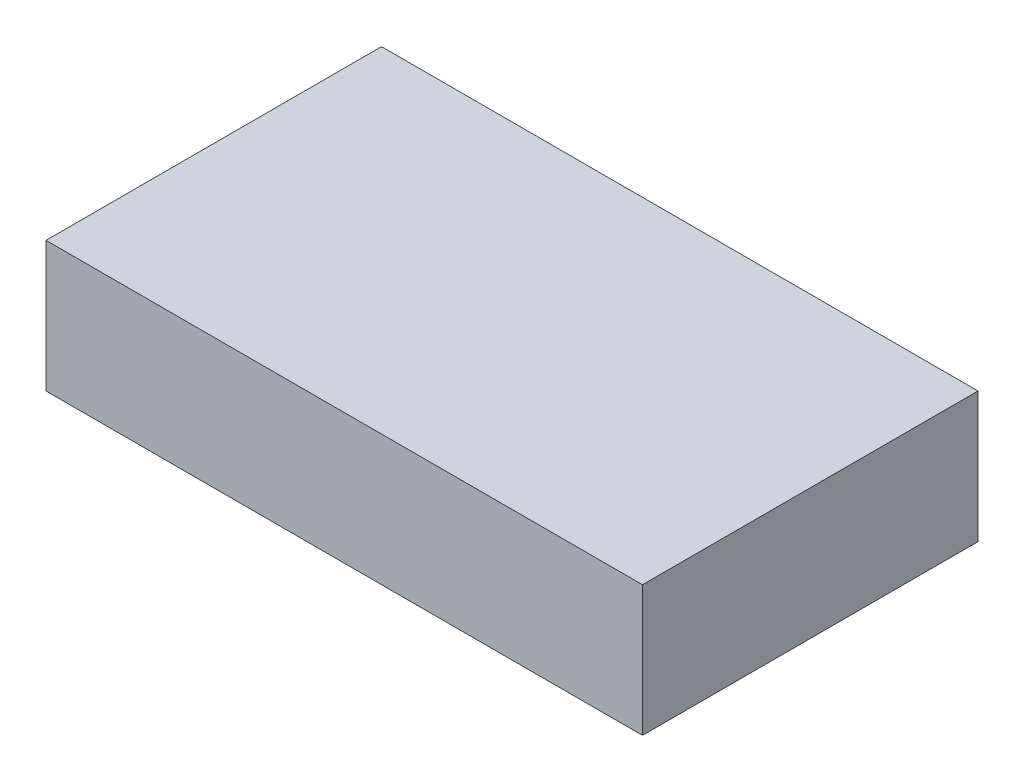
ISO-10303-21;
HEADER;
FILE_DESCRIPTION(('STEP AP214'),'2;1');
FILE_NAME('part.step','',(''),(''),'','','');
FILE_SCHEMA(('AUTOMOTIVE_DESIGN { 1 0 10303 214 1 1 1 1 }'));
ENDSEC;
DATA;
#1=APPLICATION_CONTEXT('core data for automotive mechanical design processes');
#2=APPLICATION_PROTOCOL_DEFINITION('international standard','automotive_design',2000,#1);
#3=PRODUCT_CONTEXT('',#1,'mechanical');
#4=PRODUCT('Part','Part','',(#3));
#5=PRODUCT_RELATED_PRODUCT_CATEGORY('part','',(#4));
#6=PRODUCT_DEFINITION_FORMATION('','',#4);
#7=PRODUCT_DEFINITION_CONTEXT('part definition',#1,'design');
#8=PRODUCT_DEFINITION('design','',#6,#7);
#9=PRODUCT_DEFINITION_SHAPE('','',#8);
#10=(LENGTH_UNIT() NAMED_UNIT(*) SI_UNIT(.MILLI.,.METRE.));
#11=(NAMED_UNIT(*) PLANE_ANGLE_UNIT() SI_UNIT($,.RADIAN.));
#12=(NAMED_UNIT(*) SI_UNIT($,.STERADIAN.) SOLID_ANGLE_UNIT());
#13=UNCERTAINTY_MEASURE_WITH_UNIT(LENGTH_MEASURE(1.E-05),#10,'distance_accuracy_value','');
#14=(GEOMETRIC_REPRESENTATION_CONTEXT(3) GLOBAL_UNCERTAINTY_ASSIGNED_CONTEXT((#13)) GLOBAL_UNIT_ASSIGNED_CONTEXT((#10,
#11,#12)) REPRESENTATION_CONTEXT('',''));
#15=CARTESIAN_POINT('',(0.,0.,0.));
#16=DIRECTION('',(0.,0.,1.));
#17=DIRECTION('',(1.,0.,0.));
#18=AXIS2_PLACEMENT_3D('',#15,#16,#17);
#19=CARTESIAN_POINT('',(16.,7.,9.));
#20=DIRECTION('',(-1.,0.,0.));
#21=DIRECTION('',(0.,0.,1.));
#22=AXIS2_PLACEMENT_3D('',#19,#20,#21);
#23=PLANE('',#22);
#24=DIRECTION('',(0.,0.,-1.));
#25=VECTOR('',#24,1.);
#26=CARTESIAN_POINT('',(16.,0.,9.));
#27=LINE('',#26,#25);
#28=CARTESIAN_POINT('',(16.,0.,9.));
#29=VERTEX_POINT('',#28);
#30=CARTESIAN_POINT('',(16.,0.,-9.));
#31=VERTEX_POINT('',#30);
#32=EDGE_CURVE('E107',#29,#31,#27,.T.);
#33=ORIENTED_EDGE('',*,*,#32,.T.);
#34=DIRECTION('',(0.,-1.,0.));
#35=VECTOR('',#34,1.);
#36=CARTESIAN_POINT('',(16.,7.,-9.));
#37=LINE('',#36,#35);
#38=CARTESIAN_POINT('',(16.,7.,-9.));
#39=VERTEX_POINT('',#38);
#40=EDGE_CURVE('E11',#39,#31,#37,.T.);
#41=ORIENTED_EDGE('',*,*,#40,.F.);
#42=DIRECTION('',(0.,0.,-1.));
#43=VECTOR('',#42,1.);
#44=CARTESIAN_POINT('',(16.,7.,9.));
#45=LINE('',#44,#43);
#46=CARTESIAN_POINT('',(16.,7.,9.));
#47=VERTEX_POINT('',#46);
#48=EDGE_CURVE('E91',#47,#39,#45,.T.);
#49=ORIENTED_EDGE('',*,*,#48,.F.);
#50=DIRECTION('',(0.,-1.,0.));
#51=VECTOR('',#50,1.);
#52=CARTESIAN_POINT('',(16.,7.,9.));
#53=LINE('',#52,#51);
#54=EDGE_CURVE('E103',#47,#29,#53,.T.);
#55=ORIENTED_EDGE('',*,*,#54,.T.);
#56=EDGE_LOOP('',(#33,#41,#49,#55));
#57=FACE_BOUND('',#56,.T.);
#58=ADVANCED_FACE('F39',(#57),#23,.F.);
#59=CARTESIAN_POINT('',(-16.,7.,-9.));
#60=DIRECTION('',(0.,0.,1.));
#61=DIRECTION('',(1.,0.,0.));
#62=AXIS2_PLACEMENT_3D('',#59,#60,#61);
#63=PLANE('',#62);
#64=DIRECTION('',(-1.,0.,0.));
#65=VECTOR('',#64,1.);
#66=CARTESIAN_POINT('',(-16.,0.,-9.));
#67=LINE('',#66,#65);
#68=CARTESIAN_POINT('',(-16.,0.,-9.));
#69=VERTEX_POINT('',#68);
#70=EDGE_CURVE('E96',#31,#69,#67,.T.);
#71=ORIENTED_EDGE('',*,*,#70,.T.);
#72=DIRECTION('',(0.,-1.,0.));
#73=VECTOR('',#72,1.);
#74=CARTESIAN_POINT('',(-16.,7.,-9.));
#75=LINE('',#74,#73);
#76=CARTESIAN_POINT('',(-16.,7.,-9.));
#77=VERTEX_POINT('',#76);
#78=EDGE_CURVE('E48',#77,#69,#75,.T.);
#79=ORIENTED_EDGE('',*,*,#78,.F.);
#80=DIRECTION('',(-1.,0.,0.));
#81=VECTOR('',#80,1.);
#82=CARTESIAN_POINT('',(-16.,7.,-9.));
#83=LINE('',#82,#81);
#84=EDGE_CURVE('E86',#39,#77,#83,.T.);
#85=ORIENTED_EDGE('',*,*,#84,.F.);
#86=ORIENTED_EDGE('',*,*,#40,.T.);
#87=EDGE_LOOP('',(#71,#79,#85,#86));
#88=FACE_BOUND('',#87,.T.);
#89=ADVANCED_FACE('F95',(#88),#63,.F.);
#90=CARTESIAN_POINT('',(-16.,7.,9.));
#91=DIRECTION('',(1.,0.,0.));
#92=DIRECTION('',(0.,0.,-1.));
#93=AXIS2_PLACEMENT_3D('',#90,#91,#92);
#94=PLANE('',#93);
#95=DIRECTION('',(0.,0.,1.));
#96=VECTOR('',#95,1.);
#97=CARTESIAN_POINT('',(-16.,0.,9.));
#98=LINE('',#97,#96);
#99=CARTESIAN_POINT('',(-16.,0.,9.));
#100=VERTEX_POINT('',#99);
#101=EDGE_CURVE('E73',#69,#100,#98,.T.);
#102=ORIENTED_EDGE('',*,*,#101,.T.);
#103=DIRECTION('',(0.,-1.,0.));
#104=VECTOR('',#103,1.);
#105=CARTESIAN_POINT('',(-16.,7.,9.));
#106=LINE('',#105,#104);
#107=CARTESIAN_POINT('',(-16.,7.,9.));
#108=VERTEX_POINT('',#107);
#109=EDGE_CURVE('E98',#108,#100,#106,.T.);
#110=ORIENTED_EDGE('',*,*,#109,.F.);
#111=DIRECTION('',(0.,0.,1.));
#112=VECTOR('',#111,1.);
#113=CARTESIAN_POINT('',(-16.,7.,9.));
#114=LINE('',#113,#112);
#115=EDGE_CURVE('E89',#77,#108,#114,.T.);
#116=ORIENTED_EDGE('',*,*,#115,.F.);
#117=ORIENTED_EDGE('',*,*,#78,.T.);
#118=EDGE_LOOP('',(#102,#110,#116,#117));
#119=FACE_BOUND('',#118,.T.);
#120=ADVANCED_FACE('F99',(#119),#94,.F.);
#121=CARTESIAN_POINT('',(-16.,7.,9.));
#122=DIRECTION('',(0.,0.,-1.));
#123=DIRECTION('',(-1.,0.,0.));
#124=AXIS2_PLACEMENT_3D('',#121,#122,#123);
#125=PLANE('',#124);
#126=DIRECTION('',(1.,0.,0.));
#127=VECTOR('',#126,1.);
#128=CARTESIAN_POINT('',(-16.,0.,9.));
#129=LINE('',#128,#127);
#130=EDGE_CURVE('E79',#100,#29,#129,.T.);
#131=ORIENTED_EDGE('',*,*,#130,.T.);
#132=ORIENTED_EDGE('',*,*,#54,.F.);
#133=DIRECTION('',(1.,0.,0.));
#134=VECTOR('',#133,1.);
#135=CARTESIAN_POINT('',(-16.,7.,9.));
#136=LINE('',#135,#134);
#137=EDGE_CURVE('E56',#108,#47,#136,.T.);
#138=ORIENTED_EDGE('',*,*,#137,.F.);
#139=ORIENTED_EDGE('',*,*,#109,.T.);
#140=EDGE_LOOP('',(#131,#132,#138,#139));
#141=FACE_BOUND('',#140,.T.);
#142=ADVANCED_FACE('F120',(#141),#125,.F.);
#143=CARTESIAN_POINT('',(0.,7.,0.));
#144=DIRECTION('',(0.,-1.,0.));
#145=DIRECTION('',(0.,0.,-1.));
#146=AXIS2_PLACEMENT_3D('',#143,#144,#145);
#147=PLANE('',#146);
#148=ORIENTED_EDGE('',*,*,#48,.T.);
#149=ORIENTED_EDGE('',*,*,#84,.T.);
#150=ORIENTED_EDGE('',*,*,#115,.T.);
#151=ORIENTED_EDGE('',*,*,#137,.T.);
#152=EDGE_LOOP('',(#148,#149,#150,#151));
#153=FACE_BOUND('',#152,.T.);
#154=ADVANCED_FACE('F87',(#153),#147,.F.);
#155=CARTESIAN_POINT('',(0.,0.,0.));
#156=DIRECTION('',(0.,-1.,0.));
#157=DIRECTION('',(0.,0.,-1.));
#158=AXIS2_PLACEMENT_3D('',#155,#156,#157);
#159=PLANE('',#158);
#160=ORIENTED_EDGE('',*,*,#32,.F.);
#161=ORIENTED_EDGE('',*,*,#130,.F.);
#162=ORIENTED_EDGE('',*,*,#101,.F.);
#163=ORIENTED_EDGE('',*,*,#70,.F.);
#164=EDGE_LOOP('',(#160,#161,#162,#163));
#165=FACE_BOUND('',#164,.T.);
#166=ADVANCED_FACE('F123',(#165),#159,.T.);
#167=CLOSED_SHELL('',(#58,#89,#120,#142,#154,#166));
#168=MANIFOLD_SOLID_BREP('B2',#167);
#169=ADVANCED_BREP_SHAPE_REPRESENTATION('',(#18,#168),#14);
#170=SHAPE_DEFINITION_REPRESENTATION(#9,#169);
ENDSEC;
END-ISO-10303-21;
